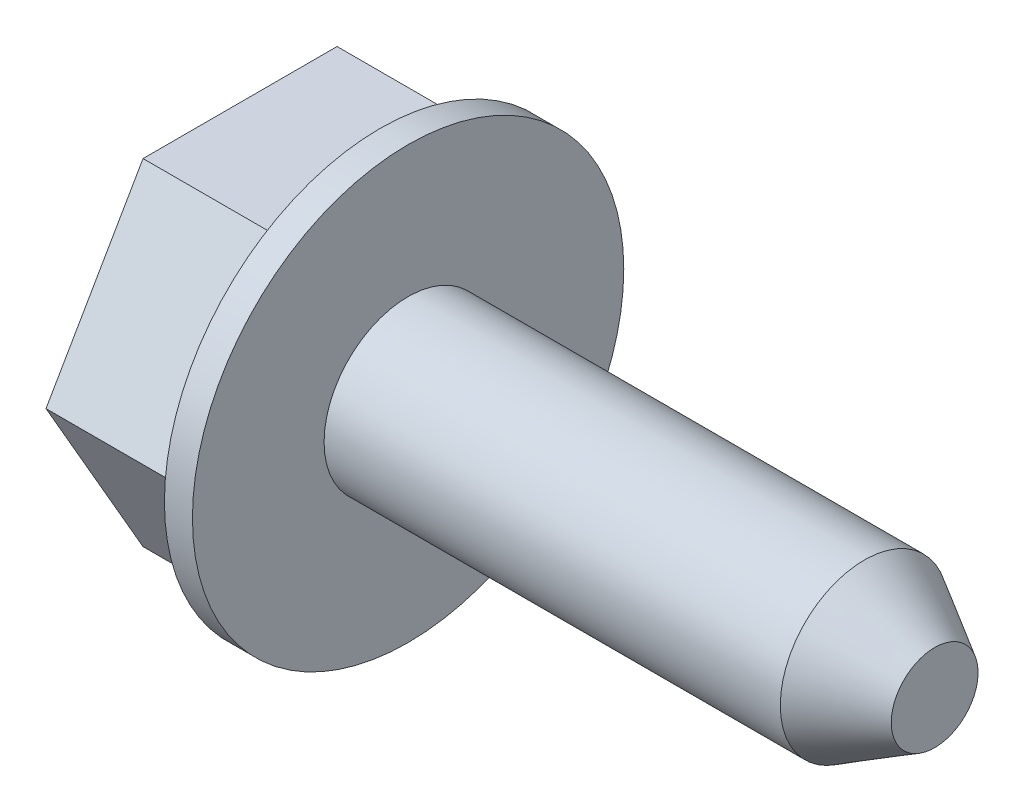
from build123d import *

# Parameters (mm, degrees)
EXTRUDE1_REACH = 8.88


with BuildPart() as part:
    # Sketch1 → base-Revolve (revolve)
    with BuildSketch(Plane.XY, mode=Mode.PRIVATE) as base_revolve_sk:
        Polygon((0, 1.9558), (-0.254, 1.9558), (-0.254, 1.524), (-1.524, 1.524), (-1.524, 1.2192), (-1.27, 1.2192), (-1.27, 0), (0, 0), (4.7752, 0), (4.7752, 0.762), (0, 0.762), align=None)
    revolve(base_revolve_sk.sketch.rotate(Axis((0, 0, 0), (1, 0, 0)), 90), axis=Axis((0, 0, 0), (1, 0, 0)))

    # Sketch15 → Extrude1 (add, up to next)
    with BuildSketch(Plane.ZY.offset(1.524), mode=Mode.PRIVATE) as extrude1_sk1:
        with BuildLine():
            ThreePointArc((-1.319822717, -0.761999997), (-1.524, 6e-09), (-1.319822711, 0.762000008))
            Line((-1.319822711, 0.762000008), (-1.75976362, 0))
            Line((-1.75976362, 0), (-1.319822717, -0.761999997))
        make_face()
    extrude1_tool1 = extrude(extrude1_sk1.sketch, amount=-EXTRUDE1_REACH, mode=Mode.PRIVATE) - part.part
    # Sketch15 → Extrude1 (add, up to next)
    with BuildSketch(Plane.ZY.offset(1.524), mode=Mode.PRIVATE) as extrude1_sk2:
        with BuildLine():
            ThreePointArc((-1.319822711, 0.762000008), (-0.761999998, 1.319822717), (-5e-09, 1.524))
            Line((-5e-09, 1.524), (-0.87988181, 1.524))
            Line((-0.87988181, 1.524), (-1.319822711, 0.762000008))
        make_face()
    extrude1_tool2 = extrude(extrude1_sk2.sketch, amount=-EXTRUDE1_REACH, mode=Mode.PRIVATE) - part.part
    # Sketch15 → Extrude1 (add, up to next)
    with BuildSketch(Plane.ZY.offset(1.524), mode=Mode.PRIVATE) as extrude1_sk3:
        with BuildLine():
            ThreePointArc((-5e-09, 1.524), (0.761999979, 1.319822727), (1.319822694, 0.762000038))
            Line((1.319822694, 0.762000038), (0.87988181, 1.524))
            Line((0.87988181, 1.524), (-5e-09, 1.524))
        make_face()
    extrude1_tool3 = extrude(extrude1_sk3.sketch, amount=-EXTRUDE1_REACH, mode=Mode.PRIVATE) - part.part
    # Sketch15 → Extrude1 (add, up to next)
    with BuildSketch(Plane.ZY.offset(1.524), mode=Mode.PRIVATE) as extrude1_sk4:
        with BuildLine():
            Line((1.319822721, -0.76199999), (1.75976362, 0))
            Line((1.75976362, 0), (1.319822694, 0.762000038))
            ThreePointArc((1.319822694, 0.762000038), (1.472070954, 0.394440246), (1.524, 0))
            ThreePointArc((1.524, 0), (1.472070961, -0.394440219), (1.319822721, -0.76199999))
        make_face()
    extrude1_tool4 = extrude(extrude1_sk4.sketch, amount=-EXTRUDE1_REACH, mode=Mode.PRIVATE) - part.part
    # Sketch15 → Extrude1 (add, up to next)
    with BuildSketch(Plane.ZY.offset(1.524), mode=Mode.PRIVATE) as extrude1_sk5:
        with BuildLine():
            Line((0.87988181, -1.524), (1.319822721, -0.76199999))
            ThreePointArc((1.319822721, -0.76199999), (0.762000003, -1.319822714), (-5e-09, -1.524))
            Line((-5e-09, -1.524), (0.87988181, -1.524))
        make_face()
    extrude1_tool5 = extrude(extrude1_sk5.sketch, amount=-EXTRUDE1_REACH, mode=Mode.PRIVATE) - part.part
    # Sketch15 → Extrude1 (add, up to next)
    with BuildSketch(Plane.ZY.offset(1.524), mode=Mode.PRIVATE) as extrude1_sk6:
        with BuildLine():
            Line((-0.87988181, -1.524), (-5e-09, -1.524))
            ThreePointArc((-5e-09, -1.524), (-0.762000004, -1.319822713), (-1.319822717, -0.761999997))
            Line((-1.319822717, -0.761999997), (-0.87988181, -1.524))
        make_face()
    extrude1_tool6 = extrude(extrude1_sk6.sketch, amount=-EXTRUDE1_REACH, mode=Mode.PRIVATE) - part.part
    add(extrude1_tool1.solids().sort_by_distance((-1.524, 0, -1.57515))[0])
    add(extrude1_tool2.solids().sort_by_distance((-1.524, 1.36412, -0.787575))[0])
    add(extrude1_tool3.solids().sort_by_distance((-1.524, 1.36412, 0.787575))[0])
    add(extrude1_tool4.solids().sort_by_distance((-1.524, 0, 1.57515))[0])
    add(extrude1_tool5.solids().sort_by_distance((-1.524, -1.36412, 0.787575))[0])
    add(extrude1_tool6.solids().sort_by_distance((-1.524, -1.36412, -0.787575))[0])

    # Sketch8 → point_Cut-Revolve1 (revolve, cut)
    with BuildSketch(Plane.XY, mode=Mode.PRIVATE) as point_cut_revolve1_sk:
        Polygon((4.7752, 0), (5.2832, 0), (5.2832, 1.27), (4.137285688, 1.27), (4.137285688, 0.762), (4.7752, 0.3937), align=None)
    revolve(point_cut_revolve1_sk.sketch.rotate(Axis((0, 0, 0), (1, 0, 0)), 90), axis=Axis((0, 0, 0), (1, 0, 0)), mode=Mode.SUBTRACT)


solid = part.part
